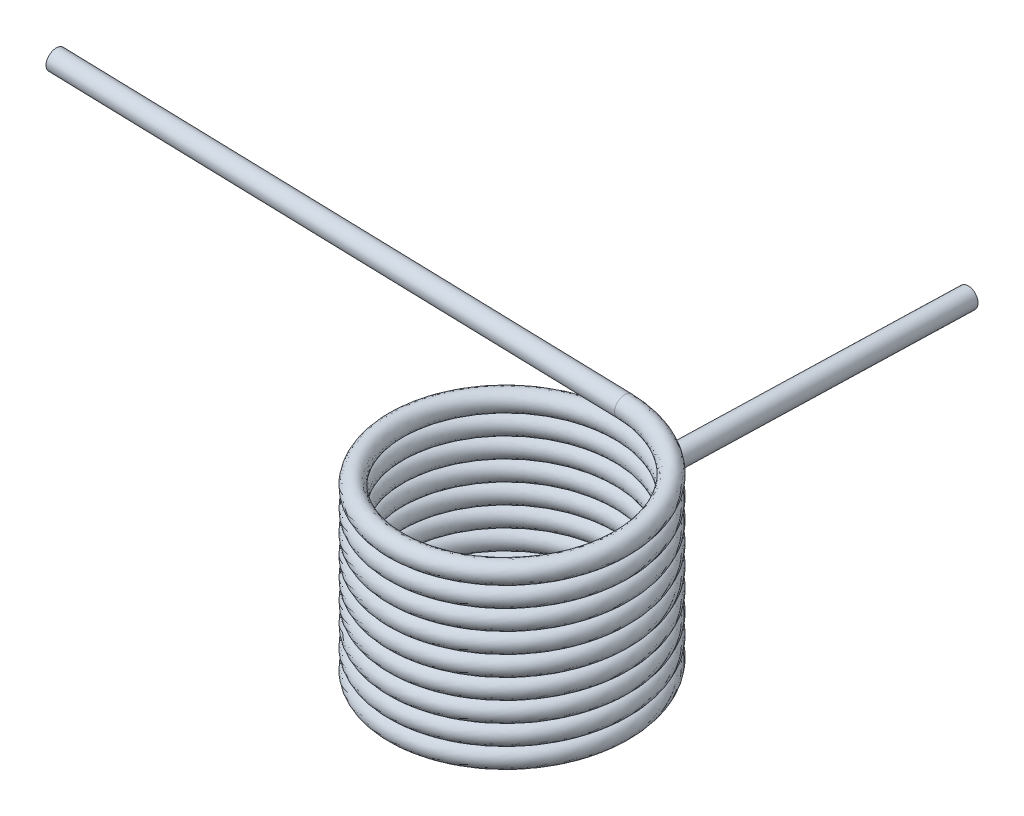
from build123d import *

# Parameters (mm, degrees)
SWEEP1_PITCH        = 1.77927
SWEEP1_HEIGHT       = 15.5686125
SWEEP1_RADIUS       = 10.0457
SWEEP1_START_ANGLE  = -90
SWEEP1_PROFILE_R    = 0.889
SKETCH14_R          = 0.889
BOSS_EXTRUDE3_DEPTH = 50.8
SKETCH17_R          = 0.889
BOSS_EXTRUDE4_DEPTH = 50.8


with BuildPart() as part:
    # Sweep1: sweep along a helix
    with BuildLine() as sweep1_path:
        add(Helix(SWEEP1_PITCH, SWEEP1_HEIGHT, SWEEP1_RADIUS, center=(0, 0, 0), direction=(0, 1, 0), mode=Mode.PRIVATE).rotate(Axis((0, 0, 0), (0, 1, 0)), SWEEP1_START_ANGLE))
    # Sweep1 profile (on start of the path) → Sweep1 (sweep)
    with BuildSketch(Plane(origin=(-10.0457, 0, 0), x_dir=(0, 0.9996029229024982, -0.028177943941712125), z_dir=(3.437940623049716e-13, 0.028177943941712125, 0.9996029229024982))):
        Circle(SWEEP1_PROFILE_R)
    sweep(path=sweep1_path.line, is_frenet=True)

    # Sketch14 → Boss-Extrude3 (add)
    with BuildSketch(Plane(origin=(-0.438517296, 0.012361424, 0), x_dir=(0, 0, 1), z_dir=(-0.9996029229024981, 0.0281779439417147, 9.467001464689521e-15))):
        with Locations(Location((-10.0457, 15.562430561, 0), (0, 0, 90))):
            Circle(SKETCH14_R)
    extrude(amount=BOSS_EXTRUDE3_DEPTH)

    # Sketch17 → Boss-Extrude4 (add)
    with BuildSketch(Plane(origin=(0, 0, 0), x_dir=(1, 0, 0), z_dir=(-1.061658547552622e-14, -0.028177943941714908, -0.9996029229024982))):
        with Locations(Location((-10.0457, 0, 0), (0, 0, 90))):
            Circle(SKETCH17_R)
    extrude(amount=BOSS_EXTRUDE4_DEPTH)


solid = part.part
